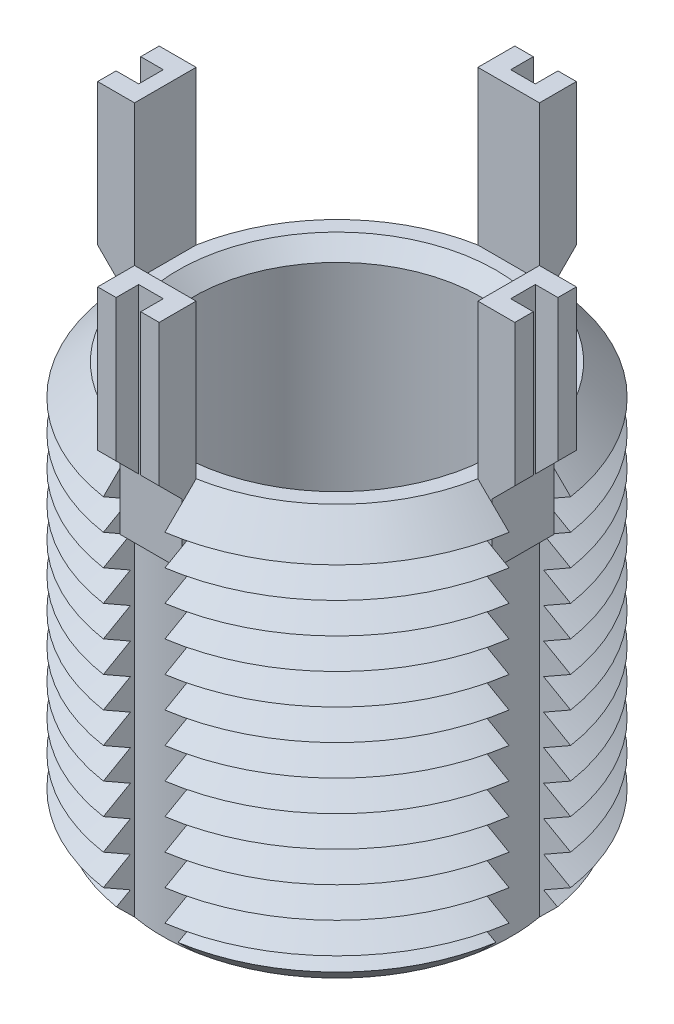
from build123d import *

# Parameters (mm, degrees)
SKETCH1_R               = 10
BOSS_EXTRUDE1_DEPTH     = 20
CHAMFER1_SIZE           = 1.5
LPATTERN1_COUNT         = 12
LPATTERN1_PITCH         = 1.5
CUT_EXTRUDE1_REACH      = 26.495
CIRPATTERN1_COUNT       = 4
BOSS_EXTRUDE3_DEPTH     = 1.5
CIRPATTERN2_COUNT       = 4
CUT_EXTRUDE3_DEPTH      = 32.031750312
CUT_EXTRUDE3_DEPTH_BACK = 32.031750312
SKETCH6_W               = 1.1
SKETCH6_H               = 1.2
SKETCH6_W_2             = 1.2
SKETCH6_H_2             = 1.1
SKETCH7_R               = 7
CUT_EXTRUDE4_DEPTH      = 20
CHAMFER2_SIZE           = 0.75


with BuildPart() as part:
    # Sketch1 → Boss-Extrude1 (new body)
    with BuildSketch(Plane(origin=(0, 0, 0), x_dir=(1, 0, 0), z_dir=(0, 1, 0))):
        with Locations(Location((0, 0, 0), (0, 0, 270))):
            Circle(SKETCH1_R)
    extrude(amount=-BOSS_EXTRUDE1_DEPTH)

    # Chamfer1
    chamfer1_edges = [part.edges().sort_by_distance(p)[0] for p in [
        (0, 0, -10),
        (0, -20, -10),
    ]]
    chamfer(chamfer1_edges, length=CHAMFER1_SIZE)

    # Sketch3 → Cut-Revolve1 (revolve, cut)
    with BuildSketch(Plane(origin=(0, 0, 0), x_dir=(0, 0, -1), z_dir=(1, 0, 0))):
        Polygon((-10, -1.5), (-8.700961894, -2.25), (-10, -3), align=None)
    cut_revolve1 = revolve(axis=Axis((0, 0.885892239, 0), (0, -1, 0)), mode=Mode.SUBTRACT)

    # LPattern1: Cut-Revolve1 ×12
    with Locations(*[(0, -i * LPATTERN1_PITCH, 0) for i in range(1, LPATTERN1_COUNT)]):
        add(cut_revolve1, mode=Mode.SUBTRACT)

    # Cut-Extrude1: up to this cone (the profile starts inside it)
    cut_extrude1_end = Plane(origin=(0, 0, 0), z_dir=(0, 1, 0)).offset(-28.499999) * Cone(1e-06, 83.995, 83.994999, align=(Align.CENTER, Align.CENTER, Align.MIN), mode=Mode.PRIVATE)
    # Sketch4 → Cut-Extrude1 (cut, up to the surface)
    with BuildSketch(Plane(origin=(0, 0, 0), x_dir=(1, 0, 0), z_dir=(0, 1, 0)), mode=Mode.PRIVATE) as cut_extrude1_sk1:
        with BuildLine():
            Line((-8.366600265, 1.5), (-9.886859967, 1.5))
            ThreePointArc((-9.886859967, 1.5), (-10, 0), (-9.886859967, -1.5))
            Line((-9.886859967, -1.5), (-8.366600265, -1.5))
            ThreePointArc((-8.366600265, -1.5), (-8.5, 0), (-8.366600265, 1.5))
        make_face()
    cut_extrude1_tool1 = extrude(cut_extrude1_sk1.sketch, amount=-CUT_EXTRUDE1_REACH, mode=Mode.PRIVATE) & cut_extrude1_end
    cut_extrude1 = cut_extrude1_tool1.solids().sort_by_distance((-9.208876, 0, 0))[0]
    add(cut_extrude1, mode=Mode.SUBTRACT)

    # CirPattern1: Cut-Extrude1 ×4 about axis
    cirpattern1_axis = Axis((0, 0, 0), (0, 1, 0))
    for i in range(1, CIRPATTERN1_COUNT):
        add(cut_extrude1.rotate(cirpattern1_axis, i * 360 / CIRPATTERN1_COUNT), mode=Mode.SUBTRACT)

    # Sketch5 → Boss-Extrude3 (add, symmetric)
    with BuildSketch(Plane(origin=(0, 0, 0), x_dir=(0, 0, -1), z_dir=(1, 0, 0))):
        Polygon((-8.366600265, 7.5), (-8.366600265, -3.5), (-9.066600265, -3.5), (-9.066600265, -0.5), (-10.166600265, 0.6), (-10.166600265, 7.5), align=None)
    boss_extrude3 = extrude(amount=BOSS_EXTRUDE3_DEPTH, both=True)

    # CirPattern2: Boss-Extrude3 ×4 about axis
    cirpattern2_axis = Axis((0, 0, 0), (0, 1, 0))
    for i in range(1, CIRPATTERN2_COUNT):
        add(boss_extrude3.rotate(cirpattern2_axis, i * 360 / CIRPATTERN2_COUNT))

    # Sketch6 → Cut-Extrude3 (cut, two sides: drawn at the far end of the back side and taken through both)
    with BuildSketch(Plane(origin=(0, 7.5, 0), x_dir=(1, 0, 0), z_dir=(0, 1, 0)).offset(-CUT_EXTRUDE3_DEPTH_BACK)):
        with Locations((-9.616600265, 0)):
            Rectangle(SKETCH6_W, SKETCH6_H)
        with Locations((0, 9.616600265)):
            Rectangle(SKETCH6_W_2, SKETCH6_H_2)
        with Locations((9.616600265, 0)):
            Rectangle(SKETCH6_W, SKETCH6_H)
        with Locations((0, -9.616600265)):
            Rectangle(SKETCH6_W_2, SKETCH6_H_2)
    extrude(amount=CUT_EXTRUDE3_DEPTH + CUT_EXTRUDE3_DEPTH_BACK, mode=Mode.SUBTRACT)

    # Sketch7 → Cut-Extrude4 (cut)
    with BuildSketch(Plane(origin=(0, 0, 0), x_dir=(1, 0, 0), z_dir=(0, 1, 0))):
        with Locations(Location((0, 0, 0), (0, 0, 270))):
            Circle(SKETCH7_R)
    extrude(amount=-CUT_EXTRUDE4_DEPTH, mode=Mode.SUBTRACT)

    # Chamfer2
    chamfer2_edges = [part.edges().sort_by_distance(p)[0] for p in [
        (0, 0, -7),
        (0, -20, -7),
    ]]
    chamfer(chamfer2_edges, length=CHAMFER2_SIZE)


solid = part.part
